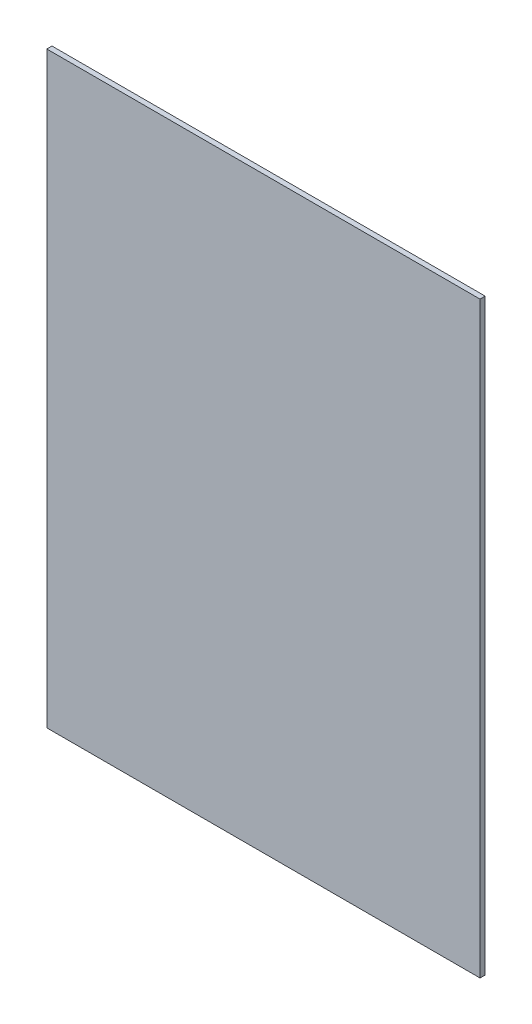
ISO-10303-21;
HEADER;
FILE_DESCRIPTION(('STEP AP214'),'2;1');
FILE_NAME('part.step','',(''),(''),'','','');
FILE_SCHEMA(('AUTOMOTIVE_DESIGN { 1 0 10303 214 1 1 1 1 }'));
ENDSEC;
DATA;
#1=APPLICATION_CONTEXT('core data for automotive mechanical design processes');
#2=APPLICATION_PROTOCOL_DEFINITION('international standard','automotive_design',2000,#1);
#3=PRODUCT_CONTEXT('',#1,'mechanical');
#4=PRODUCT('Part','Part','',(#3));
#5=PRODUCT_RELATED_PRODUCT_CATEGORY('part','',(#4));
#6=PRODUCT_DEFINITION_FORMATION('','',#4);
#7=PRODUCT_DEFINITION_CONTEXT('part definition',#1,'design');
#8=PRODUCT_DEFINITION('design','',#6,#7);
#9=PRODUCT_DEFINITION_SHAPE('','',#8);
#10=(LENGTH_UNIT() NAMED_UNIT(*) SI_UNIT(.MILLI.,.METRE.));
#11=(NAMED_UNIT(*) PLANE_ANGLE_UNIT() SI_UNIT($,.RADIAN.));
#12=(NAMED_UNIT(*) SI_UNIT($,.STERADIAN.) SOLID_ANGLE_UNIT());
#13=UNCERTAINTY_MEASURE_WITH_UNIT(LENGTH_MEASURE(1.E-05),#10,'distance_accuracy_value','');
#14=(GEOMETRIC_REPRESENTATION_CONTEXT(3) GLOBAL_UNCERTAINTY_ASSIGNED_CONTEXT((#13)) GLOBAL_UNIT_ASSIGNED_CONTEXT((#10,
#11,#12)) REPRESENTATION_CONTEXT('',''));
#15=CARTESIAN_POINT('',(0.,0.,0.));
#16=DIRECTION('',(0.,0.,1.));
#17=DIRECTION('',(1.,0.,0.));
#18=AXIS2_PLACEMENT_3D('',#15,#16,#17);
#19=CARTESIAN_POINT('',(420.,-570.,10.));
#20=DIRECTION('',(-1.,0.,0.));
#21=DIRECTION('',(0.,0.,1.));
#22=AXIS2_PLACEMENT_3D('',#19,#20,#21);
#23=PLANE('',#22);
#24=DIRECTION('',(0.,1.,0.));
#25=VECTOR('',#24,1.);
#26=CARTESIAN_POINT('',(420.,-570.,0.));
#27=LINE('',#26,#25);
#28=CARTESIAN_POINT('',(420.,-570.,0.));
#29=VERTEX_POINT('',#28);
#30=CARTESIAN_POINT('',(420.,570.,0.));
#31=VERTEX_POINT('',#30);
#32=EDGE_CURVE('E98',#29,#31,#27,.T.);
#33=ORIENTED_EDGE('',*,*,#32,.T.);
#34=DIRECTION('',(0.,0.,-1.));
#35=VECTOR('',#34,1.);
#36=CARTESIAN_POINT('',(420.,570.,10.));
#37=LINE('',#36,#35);
#38=CARTESIAN_POINT('',(420.,570.,10.));
#39=VERTEX_POINT('',#38);
#40=EDGE_CURVE('E11',#39,#31,#37,.T.);
#41=ORIENTED_EDGE('',*,*,#40,.F.);
#42=DIRECTION('',(0.,1.,0.));
#43=VECTOR('',#42,1.);
#44=CARTESIAN_POINT('',(420.,-570.,10.));
#45=LINE('',#44,#43);
#46=CARTESIAN_POINT('',(420.,-570.,10.));
#47=VERTEX_POINT('',#46);
#48=EDGE_CURVE('E86',#47,#39,#45,.T.);
#49=ORIENTED_EDGE('',*,*,#48,.F.);
#50=DIRECTION('',(0.,0.,-1.));
#51=VECTOR('',#50,1.);
#52=CARTESIAN_POINT('',(420.,-570.,10.));
#53=LINE('',#52,#51);
#54=EDGE_CURVE('E94',#47,#29,#53,.T.);
#55=ORIENTED_EDGE('',*,*,#54,.T.);
#56=EDGE_LOOP('',(#33,#41,#49,#55));
#57=FACE_BOUND('',#56,.T.);
#58=ADVANCED_FACE('F35',(#57),#23,.F.);
#59=CARTESIAN_POINT('',(-420.,570.,10.));
#60=DIRECTION('',(0.,-1.,0.));
#61=DIRECTION('',(0.,0.,-1.));
#62=AXIS2_PLACEMENT_3D('',#59,#60,#61);
#63=PLANE('',#62);
#64=DIRECTION('',(-1.,0.,0.));
#65=VECTOR('',#64,1.);
#66=CARTESIAN_POINT('',(-420.,570.,0.));
#67=LINE('',#66,#65);
#68=CARTESIAN_POINT('',(-420.,570.,0.));
#69=VERTEX_POINT('',#68);
#70=EDGE_CURVE('E90',#31,#69,#67,.T.);
#71=ORIENTED_EDGE('',*,*,#70,.T.);
#72=DIRECTION('',(0.,0.,-1.));
#73=VECTOR('',#72,1.);
#74=CARTESIAN_POINT('',(-420.,570.,10.));
#75=LINE('',#74,#73);
#76=CARTESIAN_POINT('',(-420.,570.,10.));
#77=VERTEX_POINT('',#76);
#78=EDGE_CURVE('E43',#77,#69,#75,.T.);
#79=ORIENTED_EDGE('',*,*,#78,.F.);
#80=DIRECTION('',(-1.,0.,0.));
#81=VECTOR('',#80,1.);
#82=CARTESIAN_POINT('',(-420.,570.,10.));
#83=LINE('',#82,#81);
#84=EDGE_CURVE('E81',#39,#77,#83,.T.);
#85=ORIENTED_EDGE('',*,*,#84,.F.);
#86=ORIENTED_EDGE('',*,*,#40,.T.);
#87=EDGE_LOOP('',(#71,#79,#85,#86));
#88=FACE_BOUND('',#87,.T.);
#89=ADVANCED_FACE('F89',(#88),#63,.F.);
#90=CARTESIAN_POINT('',(-420.,-570.,10.));
#91=DIRECTION('',(1.,0.,0.));
#92=DIRECTION('',(0.,0.,-1.));
#93=AXIS2_PLACEMENT_3D('',#90,#91,#92);
#94=PLANE('',#93);
#95=DIRECTION('',(0.,-1.,0.));
#96=VECTOR('',#95,1.);
#97=CARTESIAN_POINT('',(-420.,-570.,0.));
#98=LINE('',#97,#96);
#99=CARTESIAN_POINT('',(-420.,-570.,0.));
#100=VERTEX_POINT('',#99);
#101=EDGE_CURVE('E68',#69,#100,#98,.T.);
#102=ORIENTED_EDGE('',*,*,#101,.T.);
#103=DIRECTION('',(0.,0.,-1.));
#104=VECTOR('',#103,1.);
#105=CARTESIAN_POINT('',(-420.,-570.,10.));
#106=LINE('',#105,#104);
#107=CARTESIAN_POINT('',(-420.,-570.,10.));
#108=VERTEX_POINT('',#107);
#109=EDGE_CURVE('E91',#108,#100,#106,.T.);
#110=ORIENTED_EDGE('',*,*,#109,.F.);
#111=DIRECTION('',(0.,-1.,0.));
#112=VECTOR('',#111,1.);
#113=CARTESIAN_POINT('',(-420.,-570.,10.));
#114=LINE('',#113,#112);
#115=EDGE_CURVE('E84',#77,#108,#114,.T.);
#116=ORIENTED_EDGE('',*,*,#115,.F.);
#117=ORIENTED_EDGE('',*,*,#78,.T.);
#118=EDGE_LOOP('',(#102,#110,#116,#117));
#119=FACE_BOUND('',#118,.T.);
#120=ADVANCED_FACE('F92',(#119),#94,.F.);
#121=CARTESIAN_POINT('',(-420.,-570.,10.));
#122=DIRECTION('',(0.,1.,0.));
#123=DIRECTION('',(0.,0.,1.));
#124=AXIS2_PLACEMENT_3D('',#121,#122,#123);
#125=PLANE('',#124);
#126=DIRECTION('',(1.,0.,0.));
#127=VECTOR('',#126,1.);
#128=CARTESIAN_POINT('',(-420.,-570.,0.));
#129=LINE('',#128,#127);
#130=EDGE_CURVE('E74',#100,#29,#129,.T.);
#131=ORIENTED_EDGE('',*,*,#130,.T.);
#132=ORIENTED_EDGE('',*,*,#54,.F.);
#133=DIRECTION('',(1.,0.,0.));
#134=VECTOR('',#133,1.);
#135=CARTESIAN_POINT('',(-420.,-570.,10.));
#136=LINE('',#135,#134);
#137=EDGE_CURVE('E51',#108,#47,#136,.T.);
#138=ORIENTED_EDGE('',*,*,#137,.F.);
#139=ORIENTED_EDGE('',*,*,#109,.T.);
#140=EDGE_LOOP('',(#131,#132,#138,#139));
#141=FACE_BOUND('',#140,.T.);
#142=ADVANCED_FACE('F105',(#141),#125,.F.);
#143=CARTESIAN_POINT('',(0.,0.,10.));
#144=DIRECTION('',(0.,0.,-1.));
#145=DIRECTION('',(-1.,0.,0.));
#146=AXIS2_PLACEMENT_3D('',#143,#144,#145);
#147=PLANE('',#146);
#148=ORIENTED_EDGE('',*,*,#48,.T.);
#149=ORIENTED_EDGE('',*,*,#84,.T.);
#150=ORIENTED_EDGE('',*,*,#115,.T.);
#151=ORIENTED_EDGE('',*,*,#137,.T.);
#152=EDGE_LOOP('',(#148,#149,#150,#151));
#153=FACE_BOUND('',#152,.T.);
#154=ADVANCED_FACE('F82',(#153),#147,.F.);
#155=CARTESIAN_POINT('',(0.,0.,0.));
#156=DIRECTION('',(0.,0.,-1.));
#157=DIRECTION('',(-1.,0.,0.));
#158=AXIS2_PLACEMENT_3D('',#155,#156,#157);
#159=PLANE('',#158);
#160=ORIENTED_EDGE('',*,*,#32,.F.);
#161=ORIENTED_EDGE('',*,*,#130,.F.);
#162=ORIENTED_EDGE('',*,*,#101,.F.);
#163=ORIENTED_EDGE('',*,*,#70,.F.);
#164=EDGE_LOOP('',(#160,#161,#162,#163));
#165=FACE_BOUND('',#164,.T.);
#166=ADVANCED_FACE('F108',(#165),#159,.T.);
#167=CLOSED_SHELL('',(#58,#89,#120,#142,#154,#166));
#168=MANIFOLD_SOLID_BREP('B2',#167);
#169=ADVANCED_BREP_SHAPE_REPRESENTATION('',(#18,#168),#14);
#170=SHAPE_DEFINITION_REPRESENTATION(#9,#169);
ENDSEC;
END-ISO-10303-21;
